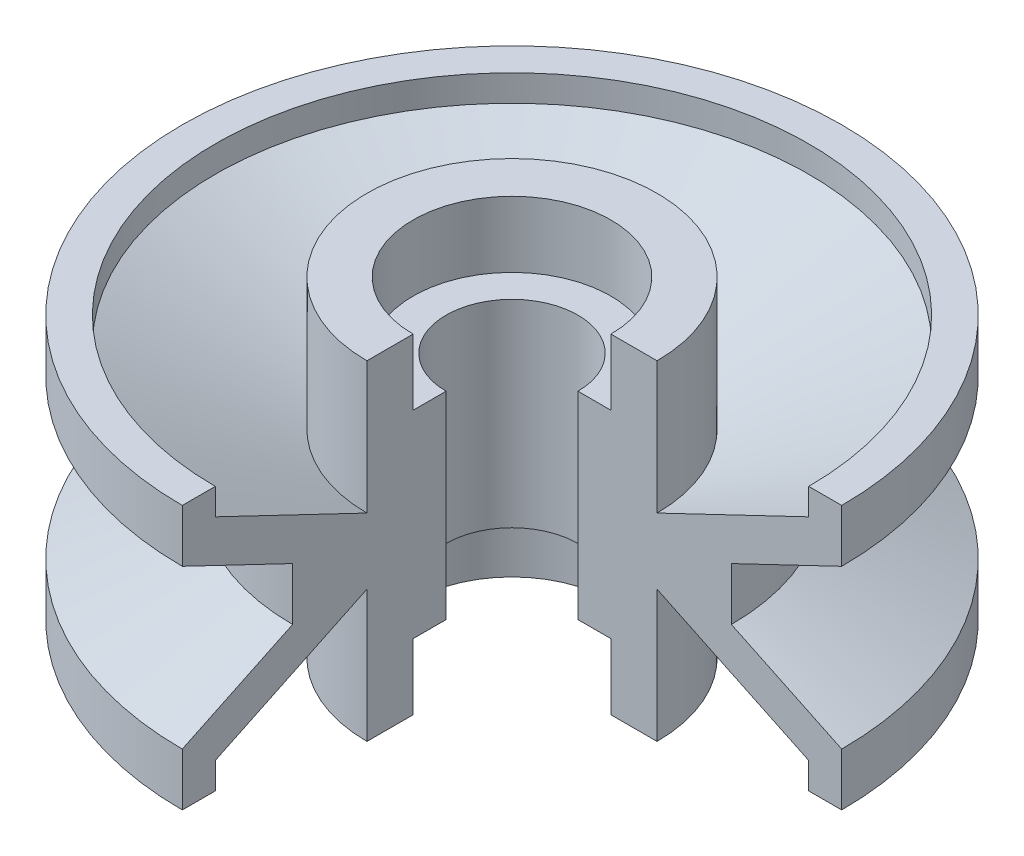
from build123d import *

# Parameters (mm, degrees)
REVOLVE1_ANGLE = 270


with BuildPart() as part:
    # Sketch1 → Revolve1 (revolve)
    with BuildSketch(Plane.XY):
        Polygon((12.7, -19.05), (12.7, 19.05), (19.05, 19.05), (19.05, 31.75), (27.94, 31.75), (27.94, 6.35), (57.15, 20.32), (57.15, 25.4), (63.5, 25.4), (63.5, 15.24), (42.256363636, 5.08), (42.256363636, -5.08), (63.5, -15.24), (63.5, -25.4), (57.15, -25.4), (57.15, -20.32), (27.94, -6.35), (27.94, -31.75), (19.05, -31.75), (19.05, -19.05), align=None)
    revolve(axis=Axis((0, 0, 0), (0, 1, 0)), revolution_arc=REVOLVE1_ANGLE)


solid = part.part
